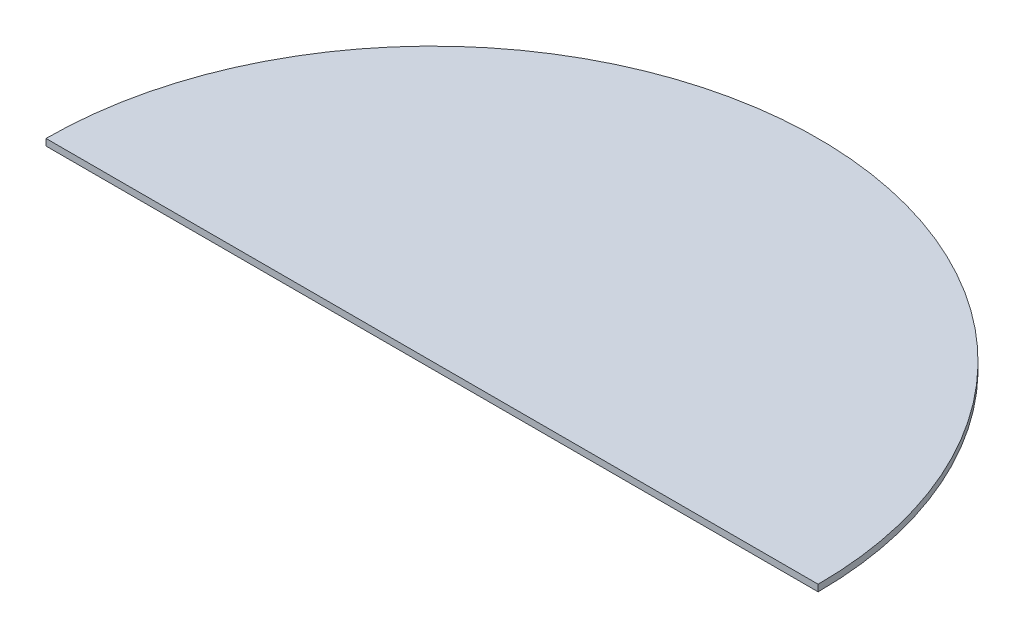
from build123d import *

# Parameters (mm, degrees)
EXTRUDE1_DEPTH = 1.2


with BuildPart() as part:
    # Sketch1 → Extrude1 (new body)
    with BuildSketch(Plane(origin=(0, 0, 0), x_dir=(1, 0, 0), z_dir=(0, 1, 0))):
        with BuildLine():
            Line((0, 0), (140, 0))
            ThreePointArc((140, 0), (70, 70), (0, 0))
        make_face()
    extrude(amount=EXTRUDE1_DEPTH)


solid = part.part
